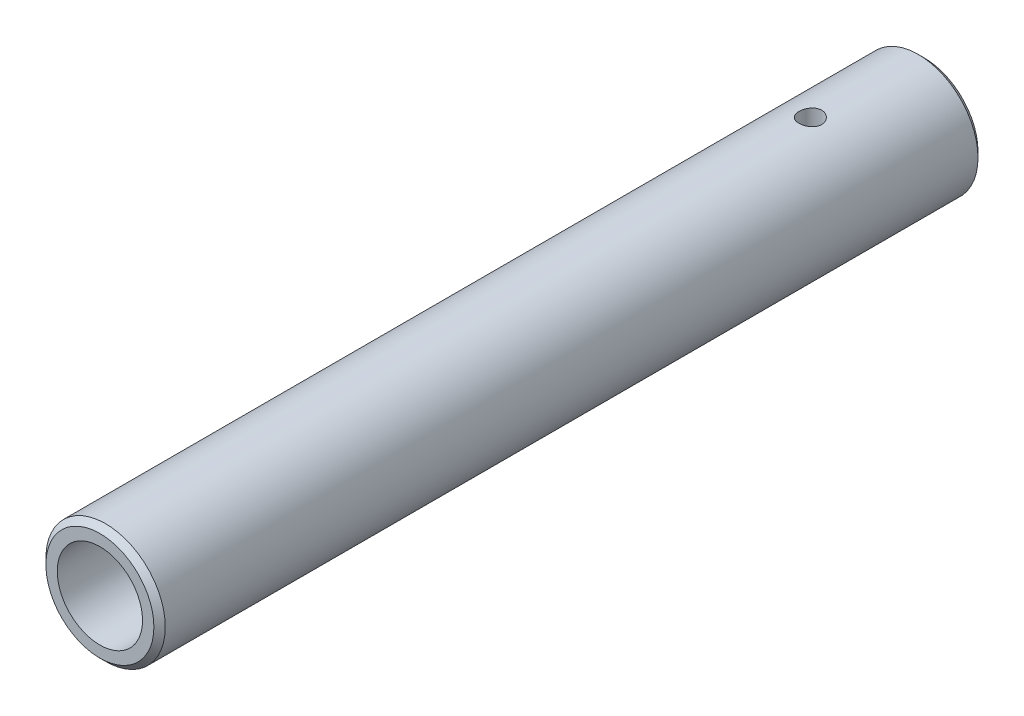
from build123d import *

# Parameters (mm, degrees)
ESQUISSE1_R                  = 10.5
ESQUISSE1_R_2                = 7.5
BASE_EXTRUSION_DEPTH         = 145
ENL_V_MAT_EXTRU_1_DEPTH      = 146.758361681
ENL_V_MAT_EXTRU_1_DEPTH_BACK = 146.758361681
ESQUISSE2_R                  = 2
CHANFREIN1_SIZE              = 1


with BuildPart() as part:
    # Esquisse1 → Base-Extrusion (new body)
    with BuildSketch(Plane.XY):
        Circle(ESQUISSE1_R)
        Circle(ESQUISSE1_R_2, mode=Mode.SUBTRACT)
    extrude(amount=BASE_EXTRUSION_DEPTH)

    # Esquisse2 → Enl_v. mat.-Extru.1 (cut, two sides: drawn at the far end of the back side and taken through both)
    with BuildSketch(Plane(origin=(0, 0, 0), x_dir=(1, 0, 0), z_dir=(0, 1, 0)).offset(-ENL_V_MAT_EXTRU_1_DEPTH_BACK)):
        with Locations(Location((0, -20, 0), (0, 0, 270))):
            Circle(ESQUISSE2_R)
    extrude(amount=ENL_V_MAT_EXTRU_1_DEPTH + ENL_V_MAT_EXTRU_1_DEPTH_BACK, mode=Mode.SUBTRACT)

    # Chanfrein1
    chanfrein1_edges = [part.edges().sort_by_distance(p)[0] for p in [
        (-10.5, 0, 0),
        (-10.5, 0, 145),
    ]]
    chamfer(chanfrein1_edges, length=CHANFREIN1_SIZE)


solid = part.part
